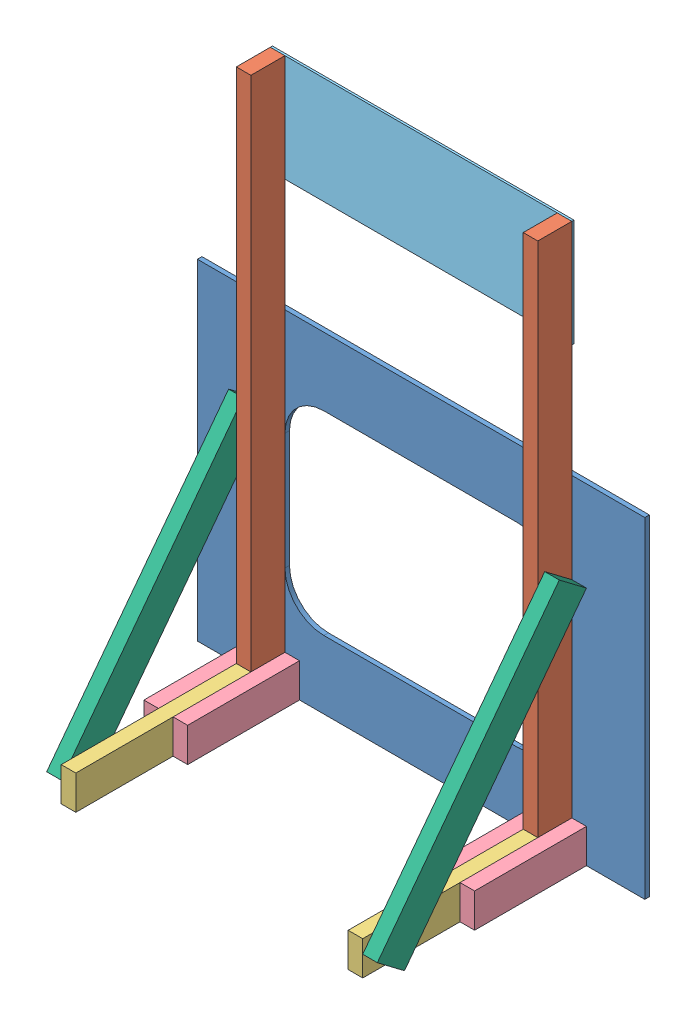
SolidWorks assembly TE-25100.SLDASM, configuration Default (file format 15000). Lengths in mm.
Overall size (1168.4 1438.27 558.01).
12 component instances, 6 part files, 38 mates.
Components (placement in the parent):
- TE-25101-1: TE-25101.SLDPRT [Default] at (1168.4 0 11.9062) x (0 0 -1) z (1 0 0) size (11.91 863.6 1168.4)
- TE-25102-1: TE-25102.SLDPRT [Default] at (228.6 0 100.8063) x (0 1 0) z (0 0 1) size (1438.27 38.1 88.9)
- TE-25102-2: TE-25102.SLDPRT [Default] at (977.9 0 100.8063) x (0 1 0) z (0 0 1) size (1438.27 38.1 88.9)
- TE-25103-1: TE-25103.SLDPRT [Default] at (190.5 0 558.0063) x (0 1 0) z (-1 0 0) size (88.9 457.2 38.1)
- TE-25103-2: TE-25103.SLDPRT [Default] at (939.8 0 558.0063) x (0 1 0) z (-1 0 0) size (88.9 457.2 38.1)
- TE-25105-2: TE-25105.SLDPRT [Default] at (977.9 0 304.0062) x (0 0 -1) z (0 -1 0) size (292.1 38.1 88.9)
- TE-25105-3: TE-25105.SLDPRT [Default] at (901.7 0 304.0062) x (0 0 -1) z (0 -1 0) size (292.1 38.1 88.9)
- TE-25105-4: TE-25105.SLDPRT [Default] at (152.4 0 304.0062) x (0 0 -1) z (0 -1 0) size (292.1 38.1 88.9)
- TE-25105-5: TE-25105.SLDPRT [Default] at (228.6 0 304.0062) x (0 0 -1) z (0 -1 0) size (292.1 38.1 88.9)
- TE-25106-1: TE-25106.SLDPRT [Default] at (584.2 1298.575 6.35) x (1 0 0) z (0 -1 0) size (787.4 5.56 279.4)
- TE-25104-1: TE-25104.SLDPRT [Default] at (996.95 654.655 47.3482) x (0 -0.797344 0.603526) z (-1 0 0) size (787.4 88.9 38.1)
- TE-25104-2: TE-25104.SLDPRT [Default] at (171.45 26.8267 522.5643) x (0 0.797344 -0.603526) z (1 0 0) size (787.4 88.9 38.1)
Mates (geometry in assembly coordinates):
- Coincident1: coincident anti-aligned: plane of TE-25101-1 through (1168.4 0 0) normal (0 0 -1)
- Coincident2: coincident anti-aligned: plane of TE-25101-1 through (1168.4 0 0) normal (0 -1 0)
- Coincident3: coincident anti-aligned: plane of TE-25101-1 through (0 0 0) normal (-1 0 0)
- Coincident4: coincident aligned: plane of TE-25102-1 through (228.6 1438.275 100.8063) normal (0 0 1); plane of TE-25102-2 through (977.9 1438.275 100.8063) normal (0 0 1)
- Coincident5: coincident anti-aligned: plane of TE-24101-1 through (1168.4 0 11.9062) normal (0 0 1); plane of TE-25102-1 through (228.6 1438.275 11.9062) normal (0 0 -1)
- Coincident6: coincident aligned: plane of TE-24101-1 through (1168.4 0 0) normal (0 -1 0); plane of TE-25102-1 through (228.6 0 100.8063) normal (0 -1 0)
- Coincident7: coincident aligned: plane of TE-24101-1 through (228.6 584.2 0) normal (1 0 0); plane of TE-25102-1 through (228.6 1438.275 100.8063) normal (1 0 0)
- Coincident8: coincident aligned: plane of TE-25102-1 through (228.6 1438.275 100.8063) normal (0 1 0); plane of TE-25102-2 through (977.9 1438.275 100.8063) normal (0 1 0)
- Coincident9: coincident aligned: plane of TE-24101-1 through (939.8 584.2 0) normal (-1 0 0); plane of TE-25102-2 through (939.8 1438.275 100.8063) normal (-1 0 0)
- Coincident10: coincident aligned: plane of TE-25102-1 through (190.5 1438.275 100.8063) normal (-1 0 0); plane of TE-25103-1 through (190.5 0 100.8063) normal (-1 0 0)
- Coincident11: coincident aligned: plane of TE-25102-1 through (228.6 0 100.8063) normal (0 -1 0); plane of TE-25103-1 through (190.5 0 100.8063) normal (0 -1 0)
- Coincident12: coincident anti-aligned: plane of TE-25102-1 through (228.6 1438.275 100.8063) normal (0 0 1); plane of TE-25103-1 through (190.5 0 100.8063) normal (0 0 -1)
- Coincident13: coincident aligned: plane of TE-25102-2 through (977.9 0 100.8063) normal (0 -1 0); plane of TE-25103-2 through (939.8 0 100.8063) normal (0 -1 0)
- Coincident14: coincident anti-aligned: plane of TE-25102-2 through (977.9 1438.275 100.8063) normal (0 0 1); plane of TE-25103-2 through (939.8 0 100.8063) normal (0 0 -1)
- Coincident15: coincident aligned: plane of TE-25102-2 through (939.8 1438.275 100.8063) normal (-1 0 0); plane of TE-25103-2 through (939.8 0 100.8063) normal (-1 0 0)
- Coincident36: coincident aligned: plane of TE-25105-2 through (977.9 0 11.9062) normal (0 0 -1); plane of TE-25105-3 through (901.7 0 11.9062) normal (0 0 -1)
- Coincident37: coincident aligned: plane of TE-25105-2 through (977.9 0 11.9062) normal (0 0 -1); plane of TE-25105-4 through (152.4 0 11.9062) normal (0 0 -1)
- Coincident38: coincident aligned: plane of TE-25105-4 through (152.4 0 11.9062) normal (0 0 -1); plane of TE-25105-5 through (228.6 0 11.9062) normal (0 0 -1)
- Coincident39: coincident aligned: plane of TE-25105-4 through (152.4 0 11.9062) normal (0 -1 0); plane of TE-25105-5 through (228.6 0 11.9062) normal (0 -1 0)
- Coincident40: coincident aligned: plane of TE-25105-3 through (901.7 0 11.9062) normal (0 -1 0); plane of TE-25105-5 through (228.6 0 11.9062) normal (0 -1 0)
- Coincident42: coincident aligned: plane of TE-25105-2 through (977.9 0 11.9062) normal (0 -1 0); plane of TE-25105-5 through (228.6 0 11.9062) normal (0 -1 0)
- Coincident43: coincident anti-aligned: plane of TE-24101-1 through (1168.4 0 11.9062) normal (0 0 1); plane of TE-25105-5 through (228.6 0 11.9062) normal (0 0 -1)
- Coincident44: coincident aligned: plane of TE-25103-1 through (190.5 0 100.8063) normal (0 -1 0); plane of TE-25105-3 through (901.7 0 11.9062) normal (0 -1 0)
- Coincident45: coincident anti-aligned: plane of TE-25102-2 through (939.8 1438.275 100.8063) normal (-1 0 0); plane of TE-25105-3 through (939.8 0 11.9062) normal (1 0 0)
- Coincident46: coincident anti-aligned: plane of TE-25103-2 through (977.9 0 100.8063) normal (1 0 0); plane of TE-25105-2 through (977.9 0 11.9062) normal (-1 0 0)
- Coincident47: coincident anti-aligned: plane of TE-25103-1 through (190.5 0 100.8063) normal (-1 0 0); plane of TE-25105-4 through (190.5 0 11.9062) normal (1 0 0)
- Coincident48: coincident anti-aligned: plane of TE-25103-1 through (228.6 0 100.8063) normal (1 0 0); plane of TE-25105-5 through (228.6 0 11.9062) normal (-1 0 0)
- Coincident51: coincident anti-aligned: plane of TE-25102-2 through (977.9 1438.275 11.9062) normal (0 0 -1); plane of TE-25107-1 through (584.2 1298.575 11.9062) normal (0 0 1)
- Coincident52: coincident aligned: plane of TE-25102-2 through (977.9 1438.275 100.8063) normal (1 0 0); plane of TE-25107-1 through (977.9 1158.875 11.9062) normal (1 0 0)
- Coincident53: coincident aligned: plane of TE-25102-2 through (977.9 1438.275 100.8063) normal (0 1 0); plane of TE-25107-1 through (190.5 1438.275 11.9062) normal (0 1 0)
- Coincident54: coincident anti-aligned: plane of TE-25103-2 through (977.9 0 100.8063) normal (1 0 0); plane of TE-25108-1 through (977.9 0 487.1224) normal (-1 0 0)
- Coincident55: coincident anti-aligned: plane of TE-25103-1 through (190.5 0 100.8063) normal (-1 0 0); plane of TE-25108-2 through (190.5 627.8283 11.9062) normal (1 0 0)
- Coincident56: coincident: plane of TE-25103-1 through (190.5 0 100.8063) normal (0 -1 0); line of TE-25108-2 through (190.5 0 487.1224) axis (-1 0 0)
- Coincident57: coincident: plane of TE-25101-1 through (1168.4 0 11.9062) normal (0 0 1); line of TE-25108-2 through (190.5 627.8283 11.9062) axis (-1 0 0)
- Coincident58: coincident: plane of TE-25103-2 through (939.8 0 100.8063) normal (0 -1 0); line of TE-25108-1 through (977.9 0 487.1224) axis (1 0 0)
- Coincident59: coincident: plane of TE-25101-1 through (1168.4 0 11.9062) normal (0 0 1); line of TE-25108-1 through (977.9 627.8283 11.9062) axis (1 0 0)
- Coincident60: coincident: plane of TE-25103-2 through (939.8 0 558.0063) normal (0 0 1); line of TE-25108-1 through (1016 53.6534 558.0063) axis (-1 0 0)
- Coincident61: coincident: plane of TE-25103-1 through (190.5 0 558.0063) normal (0 0 1); line of TE-25108-2 through (152.4 53.6534 558.0063) axis (1 0 0)
